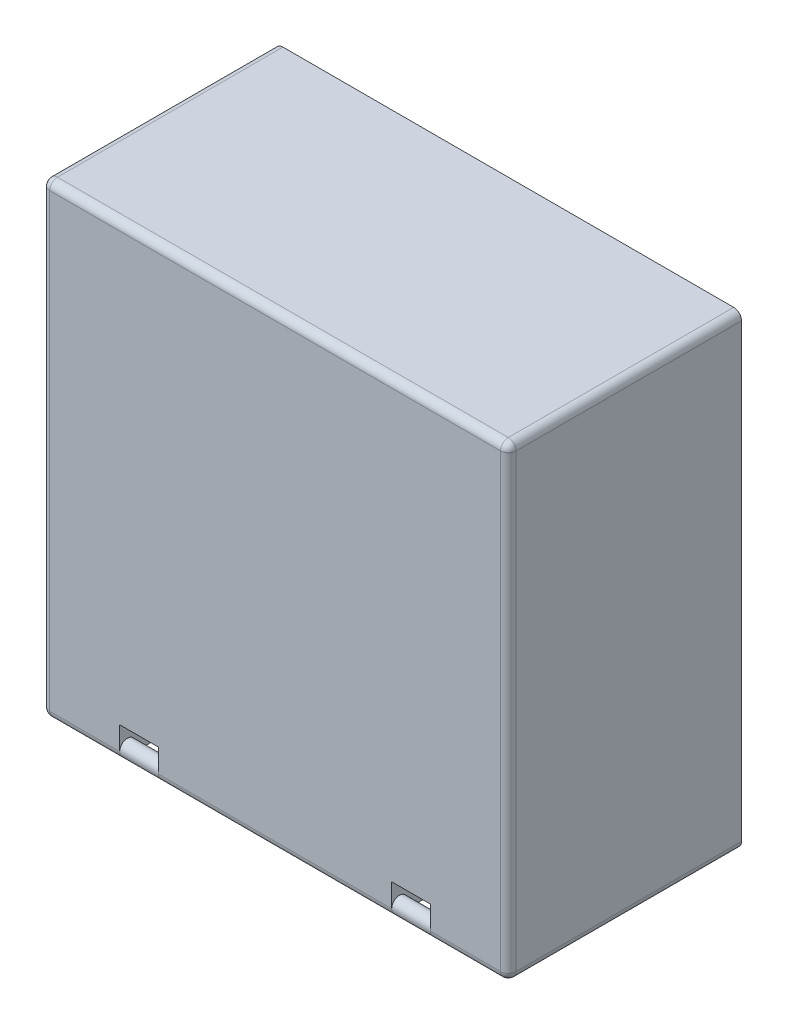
ISO-10303-21;
HEADER;
FILE_DESCRIPTION(('STEP AP214'),'2;1');
FILE_NAME('part.step','',(''),(''),'','','');
FILE_SCHEMA(('AUTOMOTIVE_DESIGN { 1 0 10303 214 1 1 1 1 }'));
ENDSEC;
DATA;
#1=APPLICATION_CONTEXT('core data for automotive mechanical design processes');
#2=APPLICATION_PROTOCOL_DEFINITION('international standard','automotive_design',2000,#1);
#3=PRODUCT_CONTEXT('',#1,'mechanical');
#4=PRODUCT('Part','Part','',(#3));
#5=PRODUCT_RELATED_PRODUCT_CATEGORY('part','',(#4));
#6=PRODUCT_DEFINITION_FORMATION('','',#4);
#7=PRODUCT_DEFINITION_CONTEXT('part definition',#1,'design');
#8=PRODUCT_DEFINITION('design','',#6,#7);
#9=PRODUCT_DEFINITION_SHAPE('','',#8);
#10=(LENGTH_UNIT() NAMED_UNIT(*) SI_UNIT(.MILLI.,.METRE.));
#11=(NAMED_UNIT(*) PLANE_ANGLE_UNIT() SI_UNIT($,.RADIAN.));
#12=(NAMED_UNIT(*) SI_UNIT($,.STERADIAN.) SOLID_ANGLE_UNIT());
#13=UNCERTAINTY_MEASURE_WITH_UNIT(LENGTH_MEASURE(1.E-05),#10,'distance_accuracy_value','');
#14=(GEOMETRIC_REPRESENTATION_CONTEXT(3) GLOBAL_UNCERTAINTY_ASSIGNED_CONTEXT((#13)) GLOBAL_UNIT_ASSIGNED_CONTEXT((#10,
#11,#12)) REPRESENTATION_CONTEXT('',''));
#15=CARTESIAN_POINT('',(0.,0.,0.));
#16=DIRECTION('',(0.,0.,1.));
#17=DIRECTION('',(1.,0.,0.));
#18=AXIS2_PLACEMENT_3D('',#15,#16,#17);
#19=CARTESIAN_POINT('',(-38.1,-38.1,38.1));
#20=DIRECTION('',(0.,1.,0.));
#21=DIRECTION('',(-1.,0.,0.));
#22=AXIS2_PLACEMENT_3D('',#19,#20,#21);
#23=PLANE('',#22);
#24=DIRECTION('',(0.,0.,-1.));
#25=VECTOR('',#24,1.);
#26=CARTESIAN_POINT('',(36.83,-38.1,38.1));
#27=LINE('',#26,#25);
#28=CARTESIAN_POINT('',(36.83,-38.1,4.57));
#29=VERTEX_POINT('',#28);
#30=CARTESIAN_POINT('',(36.83,-38.1,36.83));
#31=VERTEX_POINT('',#30);
#32=EDGE_CURVE('E498',#29,#31,#27,.F.);
#33=ORIENTED_EDGE('',*,*,#32,.T.);
#34=DIRECTION('',(1.,0.,0.));
#35=VECTOR('',#34,1.);
#36=CARTESIAN_POINT('',(-38.1,-38.1,36.83));
#37=LINE('',#36,#35);
#38=CARTESIAN_POINT('',(25.4,-38.1,36.83));
#39=VERTEX_POINT('',#38);
#40=EDGE_CURVE('E500',#31,#39,#37,.F.);
#41=ORIENTED_EDGE('',*,*,#40,.T.);
#42=DIRECTION('',(0.,0.,-1.));
#43=VECTOR('',#42,1.);
#44=CARTESIAN_POINT('',(25.4,-38.1,0.));
#45=LINE('',#44,#43);
#46=CARTESIAN_POINT('',(25.4,-38.1,33.02));
#47=VERTEX_POINT('',#46);
#48=EDGE_CURVE('E443',#39,#47,#45,.T.);
#49=ORIENTED_EDGE('',*,*,#48,.T.);
#50=DIRECTION('',(1.,0.,0.));
#51=VECTOR('',#50,1.);
#52=CARTESIAN_POINT('',(19.05,-38.1,33.02));
#53=LINE('',#52,#51);
#54=CARTESIAN_POINT('',(19.05,-38.1,33.02));
#55=VERTEX_POINT('',#54);
#56=EDGE_CURVE('E445',#55,#47,#53,.T.);
#57=ORIENTED_EDGE('',*,*,#56,.F.);
#58=DIRECTION('',(0.,0.,-1.));
#59=VECTOR('',#58,1.);
#60=CARTESIAN_POINT('',(19.05,-38.1,0.));
#61=LINE('',#60,#59);
#62=CARTESIAN_POINT('',(19.05,-38.1,36.83));
#63=VERTEX_POINT('',#62);
#64=EDGE_CURVE('E442',#63,#55,#61,.T.);
#65=ORIENTED_EDGE('',*,*,#64,.F.);
#66=DIRECTION('',(1.,0.,0.));
#67=VECTOR('',#66,1.);
#68=CARTESIAN_POINT('',(-38.1,-38.1,36.83));
#69=LINE('',#68,#67);
#70=CARTESIAN_POINT('',(-19.05,-38.1,36.83));
#71=VERTEX_POINT('',#70);
#72=EDGE_CURVE('E489',#63,#71,#69,.F.);
#73=ORIENTED_EDGE('',*,*,#72,.T.);
#74=DIRECTION('',(0.,0.,-1.));
#75=VECTOR('',#74,1.);
#76=CARTESIAN_POINT('',(-19.05,-38.1,0.));
#77=LINE('',#76,#75);
#78=CARTESIAN_POINT('',(-19.05,-38.1,33.02));
#79=VERTEX_POINT('',#78);
#80=EDGE_CURVE('E421',#71,#79,#77,.T.);
#81=ORIENTED_EDGE('',*,*,#80,.T.);
#82=DIRECTION('',(-1.,0.,0.));
#83=VECTOR('',#82,1.);
#84=CARTESIAN_POINT('',(-19.05,-38.1,33.02));
#85=LINE('',#84,#83);
#86=CARTESIAN_POINT('',(-25.4,-38.1,33.02));
#87=VERTEX_POINT('',#86);
#88=EDGE_CURVE('E430',#79,#87,#85,.T.);
#89=ORIENTED_EDGE('',*,*,#88,.T.);
#90=DIRECTION('',(0.,0.,-1.));
#91=VECTOR('',#90,1.);
#92=CARTESIAN_POINT('',(-25.4,-38.1,0.));
#93=LINE('',#92,#91);
#94=CARTESIAN_POINT('',(-25.4,-38.1,36.83));
#95=VERTEX_POINT('',#94);
#96=EDGE_CURVE('E422',#95,#87,#93,.T.);
#97=ORIENTED_EDGE('',*,*,#96,.F.);
#98=DIRECTION('',(1.,0.,0.));
#99=VECTOR('',#98,1.);
#100=CARTESIAN_POINT('',(-38.1,-38.1,36.83));
#101=LINE('',#100,#99);
#102=CARTESIAN_POINT('',(-36.83,-38.1,36.83));
#103=VERTEX_POINT('',#102);
#104=EDGE_CURVE('E491',#95,#103,#101,.F.);
#105=ORIENTED_EDGE('',*,*,#104,.T.);
#106=DIRECTION('',(0.,0.,-1.));
#107=VECTOR('',#106,1.);
#108=CARTESIAN_POINT('',(-36.83,-38.1,38.1));
#109=LINE('',#108,#107);
#110=CARTESIAN_POINT('',(-36.83,-38.1,4.57));
#111=VERTEX_POINT('',#110);
#112=EDGE_CURVE('E493',#103,#111,#109,.T.);
#113=ORIENTED_EDGE('',*,*,#112,.T.);
#114=DIRECTION('',(1.,0.,0.));
#115=VECTOR('',#114,1.);
#116=CARTESIAN_POINT('',(36.576,-38.1,4.57));
#117=LINE('',#116,#115);
#118=EDGE_CURVE('E495',#111,#29,#117,.T.);
#119=ORIENTED_EDGE('',*,*,#118,.T.);
#120=EDGE_LOOP('',(#33,#41,#49,#57,#65,#73,#81,#89,#97,#105,#113,#119));
#121=FACE_BOUND('',#120,.T.);
#122=DIRECTION('',(0.,0.,-1.));
#123=VECTOR('',#122,1.);
#124=CARTESIAN_POINT('',(-12.7,-38.1,21.24));
#125=LINE('',#124,#123);
#126=CARTESIAN_POINT('',(-12.7,-38.1,31.4));
#127=VERTEX_POINT('',#126);
#128=CARTESIAN_POINT('',(-12.7,-38.1,15.24));
#129=VERTEX_POINT('',#128);
#130=EDGE_CURVE('E59',#127,#129,#125,.T.);
#131=ORIENTED_EDGE('',*,*,#130,.F.);
#132=DIRECTION('',(1.,0.,0.));
#133=VECTOR('',#132,1.);
#134=CARTESIAN_POINT('',(12.7,-38.1,31.4));
#135=LINE('',#134,#133);
#136=CARTESIAN_POINT('',(12.7,-38.1,31.4));
#137=VERTEX_POINT('',#136);
#138=EDGE_CURVE('E589',#127,#137,#135,.T.);
#139=ORIENTED_EDGE('',*,*,#138,.T.);
#140=DIRECTION('',(0.,0.,1.));
#141=VECTOR('',#140,1.);
#142=CARTESIAN_POINT('',(12.7,-38.1,21.24));
#143=LINE('',#142,#141);
#144=CARTESIAN_POINT('',(12.7,-38.1,15.24));
#145=VERTEX_POINT('',#144);
#146=EDGE_CURVE('E66',#145,#137,#143,.T.);
#147=ORIENTED_EDGE('',*,*,#146,.F.);
#148=DIRECTION('',(1.,0.,0.));
#149=VECTOR('',#148,1.);
#150=CARTESIAN_POINT('',(-12.7,-38.1,15.24));
#151=LINE('',#150,#149);
#152=EDGE_CURVE('E593',#129,#145,#151,.T.);
#153=ORIENTED_EDGE('',*,*,#152,.F.);
#154=EDGE_LOOP('',(#131,#139,#147,#153));
#155=FACE_BOUND('',#154,.T.);
#156=ADVANCED_FACE('F43',(#121,#155),#23,.F.);
#157=CARTESIAN_POINT('',(0.,0.,0.));
#158=DIRECTION('',(0.,0.,-1.));
#159=DIRECTION('',(-1.,0.,0.));
#160=AXIS2_PLACEMENT_3D('',#157,#158,#159);
#161=PLANE('',#160);
#162=DIRECTION('',(0.,-1.,0.));
#163=VECTOR('',#162,1.);
#164=CARTESIAN_POINT('',(-36.576,0.,0.));
#165=LINE('',#164,#163);
#166=CARTESIAN_POINT('',(-36.576,36.576,0.));
#167=VERTEX_POINT('',#166);
#168=CARTESIAN_POINT('',(-36.576,-36.83,0.));
#169=VERTEX_POINT('',#168);
#170=EDGE_CURVE('E390',#167,#169,#165,.T.);
#171=ORIENTED_EDGE('',*,*,#170,.T.);
#172=CARTESIAN_POINT('',(-37.846,-36.83,0.));
#173=DIRECTION('',(0.,0.,-1.));
#174=DIRECTION('',(-1.,0.,0.));
#175=AXIS2_PLACEMENT_3D('',#172,#173,#174);
#176=CIRCLE('',#175,1.27);
#177=CARTESIAN_POINT('',(-37.338,-37.9939742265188,0.));
#178=VERTEX_POINT('',#177);
#179=EDGE_CURVE('E485',#169,#178,#176,.T.);
#180=ORIENTED_EDGE('',*,*,#179,.T.);
#181=CARTESIAN_POINT('',(-36.83,-36.83,0.));
#182=DIRECTION('',(0.,0.,-1.));
#183=DIRECTION('',(-1.,0.,0.));
#184=AXIS2_PLACEMENT_3D('',#181,#182,#183);
#185=CIRCLE('',#184,1.27);
#186=CARTESIAN_POINT('',(-38.1,-36.83,0.));
#187=VERTEX_POINT('',#186);
#188=EDGE_CURVE('E483',#178,#187,#185,.T.);
#189=ORIENTED_EDGE('',*,*,#188,.T.);
#190=DIRECTION('',(0.,-1.,0.));
#191=VECTOR('',#190,1.);
#192=CARTESIAN_POINT('',(-38.1,-38.1,0.));
#193=LINE('',#192,#191);
#194=CARTESIAN_POINT('',(-38.1,36.83,0.));
#195=VERTEX_POINT('',#194);
#196=EDGE_CURVE('E453',#195,#187,#193,.T.);
#197=ORIENTED_EDGE('',*,*,#196,.F.);
#198=CARTESIAN_POINT('',(-36.83,36.83,0.));
#199=DIRECTION('',(0.,0.,-1.));
#200=DIRECTION('',(-1.,0.,0.));
#201=AXIS2_PLACEMENT_3D('',#198,#199,#200);
#202=CIRCLE('',#201,1.27);
#203=CARTESIAN_POINT('',(-36.83,38.1,0.));
#204=VERTEX_POINT('',#203);
#205=EDGE_CURVE('E481',#195,#204,#202,.T.);
#206=ORIENTED_EDGE('',*,*,#205,.T.);
#207=DIRECTION('',(-1.,0.,0.));
#208=VECTOR('',#207,1.);
#209=CARTESIAN_POINT('',(-38.1,38.1,0.));
#210=LINE('',#209,#208);
#211=CARTESIAN_POINT('',(36.83,38.1,0.));
#212=VERTEX_POINT('',#211);
#213=EDGE_CURVE('E461',#212,#204,#210,.T.);
#214=ORIENTED_EDGE('',*,*,#213,.F.);
#215=CARTESIAN_POINT('',(36.83,36.83,0.));
#216=DIRECTION('',(0.,0.,-1.));
#217=DIRECTION('',(-1.,0.,0.));
#218=AXIS2_PLACEMENT_3D('',#215,#216,#217);
#219=CIRCLE('',#218,1.27);
#220=CARTESIAN_POINT('',(38.1,36.83,0.));
#221=VERTEX_POINT('',#220);
#222=EDGE_CURVE('E479',#212,#221,#219,.T.);
#223=ORIENTED_EDGE('',*,*,#222,.T.);
#224=DIRECTION('',(0.,1.,0.));
#225=VECTOR('',#224,1.);
#226=CARTESIAN_POINT('',(38.1,-38.1,0.));
#227=LINE('',#226,#225);
#228=CARTESIAN_POINT('',(38.1,-36.83,0.));
#229=VERTEX_POINT('',#228);
#230=EDGE_CURVE('E458',#229,#221,#227,.T.);
#231=ORIENTED_EDGE('',*,*,#230,.F.);
#232=CARTESIAN_POINT('',(36.83,-36.83,0.));
#233=DIRECTION('',(0.,0.,-1.));
#234=DIRECTION('',(-1.,0.,0.));
#235=AXIS2_PLACEMENT_3D('',#232,#233,#234);
#236=CIRCLE('',#235,1.27);
#237=CARTESIAN_POINT('',(37.338,-37.9939742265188,0.));
#238=VERTEX_POINT('',#237);
#239=EDGE_CURVE('E475',#229,#238,#236,.T.);
#240=ORIENTED_EDGE('',*,*,#239,.T.);
#241=CARTESIAN_POINT('',(37.846,-36.83,0.));
#242=DIRECTION('',(0.,0.,-1.));
#243=DIRECTION('',(-1.,0.,0.));
#244=AXIS2_PLACEMENT_3D('',#241,#242,#243);
#245=CIRCLE('',#244,1.27);
#246=CARTESIAN_POINT('',(36.576,-36.83,0.));
#247=VERTEX_POINT('',#246);
#248=EDGE_CURVE('E477',#238,#247,#245,.T.);
#249=ORIENTED_EDGE('',*,*,#248,.T.);
#250=DIRECTION('',(0.,1.,0.));
#251=VECTOR('',#250,1.);
#252=CARTESIAN_POINT('',(36.576,0.,0.));
#253=LINE('',#252,#251);
#254=CARTESIAN_POINT('',(36.576,36.576,0.));
#255=VERTEX_POINT('',#254);
#256=EDGE_CURVE('E410',#247,#255,#253,.T.);
#257=ORIENTED_EDGE('',*,*,#256,.T.);
#258=DIRECTION('',(-1.,0.,0.));
#259=VECTOR('',#258,1.);
#260=CARTESIAN_POINT('',(0.,36.576,0.));
#261=LINE('',#260,#259);
#262=EDGE_CURVE('E382',#255,#167,#261,.T.);
#263=ORIENTED_EDGE('',*,*,#262,.T.);
#264=EDGE_LOOP('',(#171,#180,#189,#197,#206,#214,#223,#231,#240,#249,#257,#263));
#265=FACE_BOUND('',#264,.T.);
#266=ADVANCED_FACE('F609',(#265),#161,.T.);
#267=CARTESIAN_POINT('',(-38.1,-36.576,38.1));
#268=DIRECTION('',(0.,1.,0.));
#269=DIRECTION('',(-1.,0.,0.));
#270=AXIS2_PLACEMENT_3D('',#267,#268,#269);
#271=PLANE('',#270);
#272=DIRECTION('',(0.,0.,-1.));
#273=VECTOR('',#272,1.);
#274=CARTESIAN_POINT('',(36.576,-36.576,38.1));
#275=LINE('',#274,#273);
#276=CARTESIAN_POINT('',(36.576,-36.576,36.576));
#277=VERTEX_POINT('',#276);
#278=CARTESIAN_POINT('',(36.576,-36.576,3.3));
#279=VERTEX_POINT('',#278);
#280=EDGE_CURVE('E342',#277,#279,#275,.T.);
#281=ORIENTED_EDGE('',*,*,#280,.T.);
#282=DIRECTION('',(-1.,0.,0.));
#283=VECTOR('',#282,1.);
#284=CARTESIAN_POINT('',(36.576,-36.576,3.3));
#285=LINE('',#284,#283);
#286=CARTESIAN_POINT('',(-36.576,-36.576,3.3));
#287=VERTEX_POINT('',#286);
#288=EDGE_CURVE('E319',#279,#287,#285,.T.);
#289=ORIENTED_EDGE('',*,*,#288,.T.);
#290=DIRECTION('',(0.,0.,-1.));
#291=VECTOR('',#290,1.);
#292=CARTESIAN_POINT('',(-36.576,-36.576,38.1));
#293=LINE('',#292,#291);
#294=CARTESIAN_POINT('',(-36.576,-36.576,36.576));
#295=VERTEX_POINT('',#294);
#296=EDGE_CURVE('E338',#295,#287,#293,.T.);
#297=ORIENTED_EDGE('',*,*,#296,.F.);
#298=DIRECTION('',(1.,0.,0.));
#299=VECTOR('',#298,1.);
#300=CARTESIAN_POINT('',(0.,-36.576,36.576));
#301=LINE('',#300,#299);
#302=CARTESIAN_POINT('',(-26.924,-36.576,36.576));
#303=VERTEX_POINT('',#302);
#304=EDGE_CURVE('E365',#295,#303,#301,.T.);
#305=ORIENTED_EDGE('',*,*,#304,.T.);
#306=DIRECTION('',(0.,0.,-1.));
#307=VECTOR('',#306,1.);
#308=CARTESIAN_POINT('',(-26.924,-36.576,0.));
#309=LINE('',#308,#307);
#310=CARTESIAN_POINT('',(-26.924,-36.576,31.496));
#311=VERTEX_POINT('',#310);
#312=EDGE_CURVE('E334',#303,#311,#309,.T.);
#313=ORIENTED_EDGE('',*,*,#312,.T.);
#314=DIRECTION('',(-1.,0.,0.));
#315=VECTOR('',#314,1.);
#316=CARTESIAN_POINT('',(-19.05,-36.576,31.496));
#317=LINE('',#316,#315);
#318=CARTESIAN_POINT('',(-17.526,-36.576,31.496));
#319=VERTEX_POINT('',#318);
#320=EDGE_CURVE('E366',#319,#311,#317,.T.);
#321=ORIENTED_EDGE('',*,*,#320,.F.);
#322=DIRECTION('',(0.,0.,-1.));
#323=VECTOR('',#322,1.);
#324=CARTESIAN_POINT('',(-17.526,-36.576,0.));
#325=LINE('',#324,#323);
#326=CARTESIAN_POINT('',(-17.526,-36.576,36.576));
#327=VERTEX_POINT('',#326);
#328=EDGE_CURVE('E327',#327,#319,#325,.T.);
#329=ORIENTED_EDGE('',*,*,#328,.F.);
#330=DIRECTION('',(1.,0.,0.));
#331=VECTOR('',#330,1.);
#332=CARTESIAN_POINT('',(0.,-36.576,36.576));
#333=LINE('',#332,#331);
#334=CARTESIAN_POINT('',(17.526,-36.576,36.576));
#335=VERTEX_POINT('',#334);
#336=EDGE_CURVE('E348',#327,#335,#333,.T.);
#337=ORIENTED_EDGE('',*,*,#336,.T.);
#338=DIRECTION('',(0.,0.,-1.));
#339=VECTOR('',#338,1.);
#340=CARTESIAN_POINT('',(17.526,-36.576,38.1));
#341=LINE('',#340,#339);
#342=CARTESIAN_POINT('',(17.526,-36.576,31.496));
#343=VERTEX_POINT('',#342);
#344=EDGE_CURVE('E359',#335,#343,#341,.T.);
#345=ORIENTED_EDGE('',*,*,#344,.T.);
#346=DIRECTION('',(1.,0.,0.));
#347=VECTOR('',#346,1.);
#348=CARTESIAN_POINT('',(19.05,-36.576,31.496));
#349=LINE('',#348,#347);
#350=CARTESIAN_POINT('',(26.924,-36.576,31.496));
#351=VERTEX_POINT('',#350);
#352=EDGE_CURVE('E354',#343,#351,#349,.T.);
#353=ORIENTED_EDGE('',*,*,#352,.T.);
#354=DIRECTION('',(0.,0.,-1.));
#355=VECTOR('',#354,1.);
#356=CARTESIAN_POINT('',(26.924,-36.576,38.1));
#357=LINE('',#356,#355);
#358=CARTESIAN_POINT('',(26.924,-36.576,36.576));
#359=VERTEX_POINT('',#358);
#360=EDGE_CURVE('E350',#359,#351,#357,.T.);
#361=ORIENTED_EDGE('',*,*,#360,.F.);
#362=DIRECTION('',(1.,0.,0.));
#363=VECTOR('',#362,1.);
#364=CARTESIAN_POINT('',(0.,-36.576,36.576));
#365=LINE('',#364,#363);
#366=EDGE_CURVE('E346',#359,#277,#365,.T.);
#367=ORIENTED_EDGE('',*,*,#366,.T.);
#368=EDGE_LOOP('',(#281,#289,#297,#305,#313,#321,#329,#337,#345,#353,#361,#367));
#369=FACE_BOUND('',#368,.T.);
#370=ADVANCED_FACE('F615',(#369),#271,.T.);
#371=CARTESIAN_POINT('',(0.,0.,38.1));
#372=DIRECTION('',(0.,0.,-1.));
#373=DIRECTION('',(-1.,0.,0.));
#374=AXIS2_PLACEMENT_3D('',#371,#372,#373);
#375=PLANE('',#374);
#376=DIRECTION('',(0.,-1.,0.));
#377=VECTOR('',#376,1.);
#378=CARTESIAN_POINT('',(25.4,0.,38.1));
#379=LINE('',#378,#377);
#380=CARTESIAN_POINT('',(25.4,-33.02,38.1));
#381=VERTEX_POINT('',#380);
#382=CARTESIAN_POINT('',(25.4,-36.83,38.1));
#383=VERTEX_POINT('',#382);
#384=EDGE_CURVE('E438',#381,#383,#379,.T.);
#385=ORIENTED_EDGE('',*,*,#384,.T.);
#386=DIRECTION('',(1.,0.,0.));
#387=VECTOR('',#386,1.);
#388=CARTESIAN_POINT('',(0.,-36.83,38.1));
#389=LINE('',#388,#387);
#390=CARTESIAN_POINT('',(36.83,-36.83,38.1));
#391=VERTEX_POINT('',#390);
#392=EDGE_CURVE('E527',#383,#391,#389,.T.);
#393=ORIENTED_EDGE('',*,*,#392,.T.);
#394=DIRECTION('',(0.,1.,0.));
#395=VECTOR('',#394,1.);
#396=CARTESIAN_POINT('',(36.83,0.,38.1));
#397=LINE('',#396,#395);
#398=CARTESIAN_POINT('',(36.83,36.83,38.1));
#399=VERTEX_POINT('',#398);
#400=EDGE_CURVE('E525',#391,#399,#397,.T.);
#401=ORIENTED_EDGE('',*,*,#400,.T.);
#402=DIRECTION('',(-1.,0.,0.));
#403=VECTOR('',#402,1.);
#404=CARTESIAN_POINT('',(0.,36.83,38.1));
#405=LINE('',#404,#403);
#406=CARTESIAN_POINT('',(-36.83,36.83,38.1));
#407=VERTEX_POINT('',#406);
#408=EDGE_CURVE('E523',#399,#407,#405,.T.);
#409=ORIENTED_EDGE('',*,*,#408,.T.);
#410=DIRECTION('',(0.,-1.,0.));
#411=VECTOR('',#410,1.);
#412=CARTESIAN_POINT('',(-36.83,0.,38.1));
#413=LINE('',#412,#411);
#414=CARTESIAN_POINT('',(-36.83,-36.83,38.1));
#415=VERTEX_POINT('',#414);
#416=EDGE_CURVE('E521',#407,#415,#413,.T.);
#417=ORIENTED_EDGE('',*,*,#416,.T.);
#418=DIRECTION('',(1.,0.,0.));
#419=VECTOR('',#418,1.);
#420=CARTESIAN_POINT('',(0.,-36.83,38.1));
#421=LINE('',#420,#419);
#422=CARTESIAN_POINT('',(-25.4,-36.83,38.1));
#423=VERTEX_POINT('',#422);
#424=EDGE_CURVE('E519',#415,#423,#421,.T.);
#425=ORIENTED_EDGE('',*,*,#424,.T.);
#426=DIRECTION('',(0.,-1.,0.));
#427=VECTOR('',#426,1.);
#428=CARTESIAN_POINT('',(-25.4,0.,38.1));
#429=LINE('',#428,#427);
#430=CARTESIAN_POINT('',(-25.4,-33.02,38.1));
#431=VERTEX_POINT('',#430);
#432=EDGE_CURVE('E417',#431,#423,#429,.T.);
#433=ORIENTED_EDGE('',*,*,#432,.F.);
#434=DIRECTION('',(-1.,0.,0.));
#435=VECTOR('',#434,1.);
#436=CARTESIAN_POINT('',(-19.05,-33.02,38.1));
#437=LINE('',#436,#435);
#438=CARTESIAN_POINT('',(-19.05,-33.02,38.1));
#439=VERTEX_POINT('',#438);
#440=EDGE_CURVE('E425',#439,#431,#437,.T.);
#441=ORIENTED_EDGE('',*,*,#440,.F.);
#442=DIRECTION('',(0.,-1.,0.));
#443=VECTOR('',#442,1.);
#444=CARTESIAN_POINT('',(-19.05,0.,38.1));
#445=LINE('',#444,#443);
#446=CARTESIAN_POINT('',(-19.05,-36.83,38.1));
#447=VERTEX_POINT('',#446);
#448=EDGE_CURVE('E418',#439,#447,#445,.T.);
#449=ORIENTED_EDGE('',*,*,#448,.T.);
#450=DIRECTION('',(1.,0.,0.));
#451=VECTOR('',#450,1.);
#452=CARTESIAN_POINT('',(0.,-36.83,38.1));
#453=LINE('',#452,#451);
#454=CARTESIAN_POINT('',(19.05,-36.83,38.1));
#455=VERTEX_POINT('',#454);
#456=EDGE_CURVE('E516',#447,#455,#453,.T.);
#457=ORIENTED_EDGE('',*,*,#456,.T.);
#458=DIRECTION('',(0.,-1.,0.));
#459=VECTOR('',#458,1.);
#460=CARTESIAN_POINT('',(19.05,0.,38.1));
#461=LINE('',#460,#459);
#462=CARTESIAN_POINT('',(19.05,-33.02,38.1));
#463=VERTEX_POINT('',#462);
#464=EDGE_CURVE('E439',#463,#455,#461,.T.);
#465=ORIENTED_EDGE('',*,*,#464,.F.);
#466=DIRECTION('',(1.,0.,0.));
#467=VECTOR('',#466,1.);
#468=CARTESIAN_POINT('',(19.05,-33.02,38.1));
#469=LINE('',#468,#467);
#470=EDGE_CURVE('E450',#463,#381,#469,.T.);
#471=ORIENTED_EDGE('',*,*,#470,.T.);
#472=EDGE_LOOP('',(#385,#393,#401,#409,#417,#425,#433,#441,#449,#457,#465,#471));
#473=FACE_BOUND('',#472,.T.);
#474=ADVANCED_FACE('F625',(#473),#375,.F.);
#475=CARTESIAN_POINT('',(-38.1,-38.1,38.1));
#476=DIRECTION('',(1.,0.,0.));
#477=DIRECTION('',(0.,1.,0.));
#478=AXIS2_PLACEMENT_3D('',#475,#476,#477);
#479=PLANE('',#478);
#480=ORIENTED_EDGE('',*,*,#196,.T.);
#481=DIRECTION('',(0.,0.,-1.));
#482=VECTOR('',#481,1.);
#483=CARTESIAN_POINT('',(-38.1,-36.83,38.1));
#484=LINE('',#483,#482);
#485=CARTESIAN_POINT('',(-38.1,-36.83,36.83));
#486=VERTEX_POINT('',#485);
#487=EDGE_CURVE('E508',#187,#486,#484,.F.);
#488=ORIENTED_EDGE('',*,*,#487,.T.);
#489=DIRECTION('',(0.,-1.,0.));
#490=VECTOR('',#489,1.);
#491=CARTESIAN_POINT('',(-38.1,-38.1,36.83));
#492=LINE('',#491,#490);
#493=CARTESIAN_POINT('',(-38.1,36.83,36.83));
#494=VERTEX_POINT('',#493);
#495=EDGE_CURVE('E504',#486,#494,#492,.F.);
#496=ORIENTED_EDGE('',*,*,#495,.T.);
#497=DIRECTION('',(0.,0.,-1.));
#498=VECTOR('',#497,1.);
#499=CARTESIAN_POINT('',(-38.1,36.83,38.1));
#500=LINE('',#499,#498);
#501=EDGE_CURVE('E506',#494,#195,#500,.T.);
#502=ORIENTED_EDGE('',*,*,#501,.T.);
#503=EDGE_LOOP('',(#480,#488,#496,#502));
#504=FACE_BOUND('',#503,.T.);
#505=ADVANCED_FACE('F622',(#504),#479,.F.);
#506=CARTESIAN_POINT('',(38.1,-38.1,38.1));
#507=DIRECTION('',(-1.,0.,0.));
#508=DIRECTION('',(0.,0.,1.));
#509=AXIS2_PLACEMENT_3D('',#506,#507,#508);
#510=PLANE('',#509);
#511=ORIENTED_EDGE('',*,*,#230,.T.);
#512=DIRECTION('',(0.,0.,-1.));
#513=VECTOR('',#512,1.);
#514=CARTESIAN_POINT('',(38.1,36.83,38.1));
#515=LINE('',#514,#513);
#516=CARTESIAN_POINT('',(38.1,36.83,36.83));
#517=VERTEX_POINT('',#516);
#518=EDGE_CURVE('E533',#221,#517,#515,.F.);
#519=ORIENTED_EDGE('',*,*,#518,.T.);
#520=DIRECTION('',(0.,1.,0.));
#521=VECTOR('',#520,1.);
#522=CARTESIAN_POINT('',(38.1,-38.1,36.83));
#523=LINE('',#522,#521);
#524=CARTESIAN_POINT('',(38.1,-36.83,36.83));
#525=VERTEX_POINT('',#524);
#526=EDGE_CURVE('E529',#517,#525,#523,.F.);
#527=ORIENTED_EDGE('',*,*,#526,.T.);
#528=DIRECTION('',(0.,0.,-1.));
#529=VECTOR('',#528,1.);
#530=CARTESIAN_POINT('',(38.1,-36.83,38.1));
#531=LINE('',#530,#529);
#532=EDGE_CURVE('E531',#525,#229,#531,.T.);
#533=ORIENTED_EDGE('',*,*,#532,.T.);
#534=EDGE_LOOP('',(#511,#519,#527,#533));
#535=FACE_BOUND('',#534,.T.);
#536=ADVANCED_FACE('F620',(#535),#510,.F.);
#537=CARTESIAN_POINT('',(-38.1,38.1,38.1));
#538=DIRECTION('',(0.,-1.,0.));
#539=DIRECTION('',(0.,0.,-1.));
#540=AXIS2_PLACEMENT_3D('',#537,#538,#539);
#541=PLANE('',#540);
#542=ORIENTED_EDGE('',*,*,#213,.T.);
#543=DIRECTION('',(0.,0.,-1.));
#544=VECTOR('',#543,1.);
#545=CARTESIAN_POINT('',(-36.83,38.1,38.1));
#546=LINE('',#545,#544);
#547=CARTESIAN_POINT('',(-36.83,38.1,36.83));
#548=VERTEX_POINT('',#547);
#549=EDGE_CURVE('E514',#204,#548,#546,.F.);
#550=ORIENTED_EDGE('',*,*,#549,.T.);
#551=DIRECTION('',(-1.,0.,0.));
#552=VECTOR('',#551,1.);
#553=CARTESIAN_POINT('',(-38.1,38.1,36.83));
#554=LINE('',#553,#552);
#555=CARTESIAN_POINT('',(36.83,38.1,36.83));
#556=VERTEX_POINT('',#555);
#557=EDGE_CURVE('E512',#548,#556,#554,.F.);
#558=ORIENTED_EDGE('',*,*,#557,.T.);
#559=DIRECTION('',(0.,0.,-1.));
#560=VECTOR('',#559,1.);
#561=CARTESIAN_POINT('',(36.83,38.1,38.1));
#562=LINE('',#561,#560);
#563=EDGE_CURVE('E510',#556,#212,#562,.T.);
#564=ORIENTED_EDGE('',*,*,#563,.T.);
#565=EDGE_LOOP('',(#542,#550,#558,#564));
#566=FACE_BOUND('',#565,.T.);
#567=ADVANCED_FACE('F747',(#566),#541,.F.);
#568=CARTESIAN_POINT('',(19.05,0.,0.));
#569=DIRECTION('',(1.,0.,0.));
#570=DIRECTION('',(0.,0.,-1.));
#571=AXIS2_PLACEMENT_3D('',#568,#569,#570);
#572=PLANE('',#571);
#573=ORIENTED_EDGE('',*,*,#64,.T.);
#574=CARTESIAN_POINT('',(19.05,-38.1,38.1));
#575=DIRECTION('',(1.,0.,0.));
#576=DIRECTION('',(0.,0.,-1.));
#577=AXIS2_PLACEMENT_3D('',#574,#575,#576);
#578=CIRCLE('',#577,5.08);
#579=EDGE_CURVE('E587',#55,#463,#578,.T.);
#580=ORIENTED_EDGE('',*,*,#579,.T.);
#581=ORIENTED_EDGE('',*,*,#464,.T.);
#582=CARTESIAN_POINT('',(19.05,-36.83,36.83));
#583=DIRECTION('',(1.,0.,0.));
#584=DIRECTION('',(0.,0.,-1.));
#585=AXIS2_PLACEMENT_3D('',#582,#583,#584);
#586=CIRCLE('',#585,1.27);
#587=EDGE_CURVE('E433',#455,#63,#586,.F.);
#588=ORIENTED_EDGE('',*,*,#587,.T.);
#589=EDGE_LOOP('',(#573,#580,#581,#588));
#590=FACE_BOUND('',#589,.T.);
#591=ADVANCED_FACE('F710',(#590),#572,.T.);
#592=CARTESIAN_POINT('',(25.4,0.,0.));
#593=DIRECTION('',(1.,0.,0.));
#594=DIRECTION('',(0.,0.,-1.));
#595=AXIS2_PLACEMENT_3D('',#592,#593,#594);
#596=PLANE('',#595);
#597=ORIENTED_EDGE('',*,*,#384,.F.);
#598=CARTESIAN_POINT('',(25.4,-38.1,38.1));
#599=DIRECTION('',(1.,0.,0.));
#600=DIRECTION('',(0.,0.,-1.));
#601=AXIS2_PLACEMENT_3D('',#598,#599,#600);
#602=CIRCLE('',#601,5.08);
#603=EDGE_CURVE('E585',#381,#47,#602,.F.);
#604=ORIENTED_EDGE('',*,*,#603,.T.);
#605=ORIENTED_EDGE('',*,*,#48,.F.);
#606=CARTESIAN_POINT('',(25.4,-36.83,36.83));
#607=DIRECTION('',(1.,0.,0.));
#608=DIRECTION('',(0.,0.,-1.));
#609=AXIS2_PLACEMENT_3D('',#606,#607,#608);
#610=CIRCLE('',#609,1.27);
#611=EDGE_CURVE('E464',#39,#383,#610,.T.);
#612=ORIENTED_EDGE('',*,*,#611,.T.);
#613=EDGE_LOOP('',(#597,#604,#605,#612));
#614=FACE_BOUND('',#613,.T.);
#615=ADVANCED_FACE('F728',(#614),#596,.F.);
#616=CARTESIAN_POINT('',(15.4578975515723,-36.83,36.83));
#617=DIRECTION('',(1.,0.,0.));
#618=DIRECTION('',(0.,0.,-1.));
#619=AXIS2_PLACEMENT_3D('',#616,#617,#618);
#620=CYLINDRICAL_SURFACE('',#619,1.27);
#621=EDGE_CURVE('E436',#63,#455,#586,.F.);
#622=ORIENTED_EDGE('',*,*,#621,.F.);
#623=ORIENTED_EDGE('',*,*,#587,.F.);
#624=EDGE_LOOP('',(#622,#623));
#625=FACE_BOUND('',#624,.T.);
#626=EDGE_CURVE('E467',#383,#39,#610,.T.);
#627=ORIENTED_EDGE('',*,*,#626,.F.);
#628=ORIENTED_EDGE('',*,*,#611,.F.);
#629=EDGE_LOOP('',(#627,#628));
#630=FACE_BOUND('',#629,.T.);
#631=ADVANCED_FACE('F720',(#625,#630),#620,.T.);
#632=CARTESIAN_POINT('',(-19.05,0.,0.));
#633=DIRECTION('',(-1.,0.,0.));
#634=DIRECTION('',(0.,0.,-1.));
#635=AXIS2_PLACEMENT_3D('',#632,#633,#634);
#636=PLANE('',#635);
#637=ORIENTED_EDGE('',*,*,#448,.F.);
#638=CARTESIAN_POINT('',(-19.05,-38.1,38.1));
#639=DIRECTION('',(-1.,0.,0.));
#640=DIRECTION('',(0.,0.,1.));
#641=AXIS2_PLACEMENT_3D('',#638,#639,#640);
#642=CIRCLE('',#641,5.08);
#643=EDGE_CURVE('E583',#439,#79,#642,.T.);
#644=ORIENTED_EDGE('',*,*,#643,.T.);
#645=ORIENTED_EDGE('',*,*,#80,.F.);
#646=CARTESIAN_POINT('',(-19.05,-36.83,36.83));
#647=DIRECTION('',(-1.,0.,0.));
#648=DIRECTION('',(0.,0.,1.));
#649=AXIS2_PLACEMENT_3D('',#646,#647,#648);
#650=CIRCLE('',#649,1.27);
#651=EDGE_CURVE('E414',#447,#71,#650,.T.);
#652=ORIENTED_EDGE('',*,*,#651,.F.);
#653=EDGE_LOOP('',(#637,#644,#645,#652));
#654=FACE_BOUND('',#653,.T.);
#655=ADVANCED_FACE('F732',(#654),#636,.T.);
#656=CARTESIAN_POINT('',(-25.4,0.,0.));
#657=DIRECTION('',(-1.,0.,0.));
#658=DIRECTION('',(0.,0.,-1.));
#659=AXIS2_PLACEMENT_3D('',#656,#657,#658);
#660=PLANE('',#659);
#661=ORIENTED_EDGE('',*,*,#96,.T.);
#662=CARTESIAN_POINT('',(-25.4,-38.1,38.1));
#663=DIRECTION('',(-1.,0.,0.));
#664=DIRECTION('',(0.,0.,1.));
#665=AXIS2_PLACEMENT_3D('',#662,#663,#664);
#666=CIRCLE('',#665,5.08);
#667=EDGE_CURVE('E534',#87,#431,#666,.F.);
#668=ORIENTED_EDGE('',*,*,#667,.T.);
#669=ORIENTED_EDGE('',*,*,#432,.T.);
#670=CARTESIAN_POINT('',(-25.4,-36.83,36.83));
#671=DIRECTION('',(-1.,0.,0.));
#672=DIRECTION('',(0.,0.,1.));
#673=AXIS2_PLACEMENT_3D('',#670,#671,#672);
#674=CIRCLE('',#673,1.27);
#675=EDGE_CURVE('E468',#95,#423,#674,.F.);
#676=ORIENTED_EDGE('',*,*,#675,.F.);
#677=EDGE_LOOP('',(#661,#668,#669,#676));
#678=FACE_BOUND('',#677,.T.);
#679=ADVANCED_FACE('F739',(#678),#660,.F.);
#680=CARTESIAN_POINT('',(22.6421024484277,-36.83,36.83));
#681=DIRECTION('',(-1.,0.,0.));
#682=DIRECTION('',(0.,0.,1.));
#683=AXIS2_PLACEMENT_3D('',#680,#681,#682);
#684=CYLINDRICAL_SURFACE('',#683,1.27);
#685=ORIENTED_EDGE('',*,*,#651,.T.);
#686=EDGE_CURVE('E341',#71,#447,#650,.T.);
#687=ORIENTED_EDGE('',*,*,#686,.T.);
#688=EDGE_LOOP('',(#685,#687));
#689=FACE_BOUND('',#688,.T.);
#690=ORIENTED_EDGE('',*,*,#675,.T.);
#691=EDGE_CURVE('E471',#423,#95,#674,.F.);
#692=ORIENTED_EDGE('',*,*,#691,.T.);
#693=EDGE_LOOP('',(#690,#692));
#694=FACE_BOUND('',#693,.T.);
#695=ADVANCED_FACE('F831',(#689,#694),#684,.T.);
#696=CARTESIAN_POINT('',(-17.526,0.,0.));
#697=DIRECTION('',(-1.,0.,0.));
#698=DIRECTION('',(0.,0.,-1.));
#699=AXIS2_PLACEMENT_3D('',#696,#697,#698);
#700=PLANE('',#699);
#701=ORIENTED_EDGE('',*,*,#328,.T.);
#702=DIRECTION('',(0.,1.,0.));
#703=VECTOR('',#702,1.);
#704=CARTESIAN_POINT('',(-17.526,0.,31.496));
#705=LINE('',#704,#703);
#706=CARTESIAN_POINT('',(-17.526,-31.496,31.496));
#707=VERTEX_POINT('',#706);
#708=EDGE_CURVE('E330',#319,#707,#705,.T.);
#709=ORIENTED_EDGE('',*,*,#708,.T.);
#710=DIRECTION('',(0.,0.,-1.));
#711=VECTOR('',#710,1.);
#712=CARTESIAN_POINT('',(-17.526,-31.496,0.));
#713=LINE('',#712,#711);
#714=CARTESIAN_POINT('',(-17.526,-31.496,36.576));
#715=VERTEX_POINT('',#714);
#716=EDGE_CURVE('E333',#715,#707,#713,.T.);
#717=ORIENTED_EDGE('',*,*,#716,.F.);
#718=DIRECTION('',(0.,-1.,0.));
#719=VECTOR('',#718,1.);
#720=CARTESIAN_POINT('',(-17.526,0.,36.576));
#721=LINE('',#720,#719);
#722=EDGE_CURVE('E331',#715,#327,#721,.T.);
#723=ORIENTED_EDGE('',*,*,#722,.T.);
#724=EDGE_LOOP('',(#701,#709,#717,#723));
#725=FACE_BOUND('',#724,.T.);
#726=ADVANCED_FACE('F832',(#725),#700,.F.);
#727=CARTESIAN_POINT('',(-26.924,0.,0.));
#728=DIRECTION('',(-1.,0.,0.));
#729=DIRECTION('',(0.,0.,-1.));
#730=AXIS2_PLACEMENT_3D('',#727,#728,#729);
#731=PLANE('',#730);
#732=ORIENTED_EDGE('',*,*,#312,.F.);
#733=DIRECTION('',(0.,-1.,0.));
#734=VECTOR('',#733,1.);
#735=CARTESIAN_POINT('',(-26.924,0.,36.576));
#736=LINE('',#735,#734);
#737=CARTESIAN_POINT('',(-26.924,-31.496,36.576));
#738=VERTEX_POINT('',#737);
#739=EDGE_CURVE('E326',#738,#303,#736,.T.);
#740=ORIENTED_EDGE('',*,*,#739,.F.);
#741=DIRECTION('',(0.,0.,-1.));
#742=VECTOR('',#741,1.);
#743=CARTESIAN_POINT('',(-26.924,-31.496,0.));
#744=LINE('',#743,#742);
#745=CARTESIAN_POINT('',(-26.924,-31.496,31.496));
#746=VERTEX_POINT('',#745);
#747=EDGE_CURVE('E377',#738,#746,#744,.T.);
#748=ORIENTED_EDGE('',*,*,#747,.T.);
#749=DIRECTION('',(0.,1.,0.));
#750=VECTOR('',#749,1.);
#751=CARTESIAN_POINT('',(-26.924,0.,31.496));
#752=LINE('',#751,#750);
#753=EDGE_CURVE('E371',#311,#746,#752,.T.);
#754=ORIENTED_EDGE('',*,*,#753,.F.);
#755=EDGE_LOOP('',(#732,#740,#748,#754));
#756=FACE_BOUND('',#755,.T.);
#757=ADVANCED_FACE('F839',(#756),#731,.T.);
#758=CARTESIAN_POINT('',(0.,0.,36.576));
#759=DIRECTION('',(0.,0.,-1.));
#760=DIRECTION('',(-1.,0.,0.));
#761=AXIS2_PLACEMENT_3D('',#758,#759,#760);
#762=PLANE('',#761);
#763=DIRECTION('',(0.,-1.,0.));
#764=VECTOR('',#763,1.);
#765=CARTESIAN_POINT('',(-36.576,0.,36.576));
#766=LINE('',#765,#764);
#767=CARTESIAN_POINT('',(-36.576,36.576,36.576));
#768=VERTEX_POINT('',#767);
#769=EDGE_CURVE('E349',#768,#295,#766,.T.);
#770=ORIENTED_EDGE('',*,*,#769,.F.);
#771=DIRECTION('',(-1.,0.,0.));
#772=VECTOR('',#771,1.);
#773=CARTESIAN_POINT('',(0.,36.576,36.576));
#774=LINE('',#773,#772);
#775=CARTESIAN_POINT('',(36.576,36.576,36.576));
#776=VERTEX_POINT('',#775);
#777=EDGE_CURVE('E393',#776,#768,#774,.T.);
#778=ORIENTED_EDGE('',*,*,#777,.F.);
#779=DIRECTION('',(0.,1.,0.));
#780=VECTOR('',#779,1.);
#781=CARTESIAN_POINT('',(36.576,0.,36.576));
#782=LINE('',#781,#780);
#783=EDGE_CURVE('E374',#277,#776,#782,.T.);
#784=ORIENTED_EDGE('',*,*,#783,.F.);
#785=ORIENTED_EDGE('',*,*,#366,.F.);
#786=DIRECTION('',(0.,-1.,0.));
#787=VECTOR('',#786,1.);
#788=CARTESIAN_POINT('',(26.924,0.,36.576));
#789=LINE('',#788,#787);
#790=CARTESIAN_POINT('',(26.924,-31.496,36.576));
#791=VERTEX_POINT('',#790);
#792=EDGE_CURVE('E353',#791,#359,#789,.T.);
#793=ORIENTED_EDGE('',*,*,#792,.F.);
#794=DIRECTION('',(1.,0.,0.));
#795=VECTOR('',#794,1.);
#796=CARTESIAN_POINT('',(19.05,-31.496,36.576));
#797=LINE('',#796,#795);
#798=CARTESIAN_POINT('',(17.526,-31.496,36.576));
#799=VERTEX_POINT('',#798);
#800=EDGE_CURVE('E387',#799,#791,#797,.T.);
#801=ORIENTED_EDGE('',*,*,#800,.F.);
#802=DIRECTION('',(0.,-1.,0.));
#803=VECTOR('',#802,1.);
#804=CARTESIAN_POINT('',(17.526,0.,36.576));
#805=LINE('',#804,#803);
#806=EDGE_CURVE('E362',#799,#335,#805,.T.);
#807=ORIENTED_EDGE('',*,*,#806,.T.);
#808=ORIENTED_EDGE('',*,*,#336,.F.);
#809=ORIENTED_EDGE('',*,*,#722,.F.);
#810=DIRECTION('',(-1.,0.,0.));
#811=VECTOR('',#810,1.);
#812=CARTESIAN_POINT('',(-19.05,-31.496,36.576));
#813=LINE('',#812,#811);
#814=EDGE_CURVE('E329',#715,#738,#813,.T.);
#815=ORIENTED_EDGE('',*,*,#814,.T.);
#816=ORIENTED_EDGE('',*,*,#739,.T.);
#817=ORIENTED_EDGE('',*,*,#304,.F.);
#818=EDGE_LOOP('',(#770,#778,#784,#785,#793,#801,#807,#808,#809,#815,#816,#817));
#819=FACE_BOUND('',#818,.T.);
#820=ADVANCED_FACE('F809',(#819),#762,.T.);
#821=CARTESIAN_POINT('',(-36.576,-38.1,38.1));
#822=DIRECTION('',(1.,0.,0.));
#823=DIRECTION('',(0.,1.,0.));
#824=AXIS2_PLACEMENT_3D('',#821,#822,#823);
#825=PLANE('',#824);
#826=DIRECTION('',(0.,-1.,0.));
#827=VECTOR('',#826,1.);
#828=CARTESIAN_POINT('',(-36.576,-36.576,3.3));
#829=LINE('',#828,#827);
#830=CARTESIAN_POINT('',(-36.576,-36.83,3.3));
#831=VERTEX_POINT('',#830);
#832=EDGE_CURVE('E323',#287,#831,#829,.T.);
#833=ORIENTED_EDGE('',*,*,#832,.T.);
#834=DIRECTION('',(0.,0.,-1.));
#835=VECTOR('',#834,1.);
#836=CARTESIAN_POINT('',(-36.576,-36.83,0.));
#837=LINE('',#836,#835);
#838=EDGE_CURVE('E472',#831,#169,#837,.T.);
#839=ORIENTED_EDGE('',*,*,#838,.T.);
#840=ORIENTED_EDGE('',*,*,#170,.F.);
#841=DIRECTION('',(0.,0.,-1.));
#842=VECTOR('',#841,1.);
#843=CARTESIAN_POINT('',(-36.576,36.576,38.1));
#844=LINE('',#843,#842);
#845=EDGE_CURVE('E395',#768,#167,#844,.T.);
#846=ORIENTED_EDGE('',*,*,#845,.F.);
#847=ORIENTED_EDGE('',*,*,#769,.T.);
#848=ORIENTED_EDGE('',*,*,#296,.T.);
#849=EDGE_LOOP('',(#833,#839,#840,#846,#847,#848));
#850=FACE_BOUND('',#849,.T.);
#851=ADVANCED_FACE('F796',(#850),#825,.T.);
#852=CARTESIAN_POINT('',(36.576,-38.1,38.1));
#853=DIRECTION('',(-1.,0.,0.));
#854=DIRECTION('',(0.,0.,1.));
#855=AXIS2_PLACEMENT_3D('',#852,#853,#854);
#856=PLANE('',#855);
#857=ORIENTED_EDGE('',*,*,#256,.F.);
#858=DIRECTION('',(0.,0.,-1.));
#859=VECTOR('',#858,1.);
#860=CARTESIAN_POINT('',(36.576,-36.83,3.3));
#861=LINE('',#860,#859);
#862=CARTESIAN_POINT('',(36.576,-36.83,3.3));
#863=VERTEX_POINT('',#862);
#864=EDGE_CURVE('E487',#247,#863,#861,.F.);
#865=ORIENTED_EDGE('',*,*,#864,.T.);
#866=DIRECTION('',(0.,1.,0.));
#867=VECTOR('',#866,1.);
#868=CARTESIAN_POINT('',(36.576,-36.576,3.3));
#869=LINE('',#868,#867);
#870=EDGE_CURVE('E317',#863,#279,#869,.T.);
#871=ORIENTED_EDGE('',*,*,#870,.T.);
#872=ORIENTED_EDGE('',*,*,#280,.F.);
#873=ORIENTED_EDGE('',*,*,#783,.T.);
#874=DIRECTION('',(0.,0.,-1.));
#875=VECTOR('',#874,1.);
#876=CARTESIAN_POINT('',(36.576,36.576,38.1));
#877=LINE('',#876,#875);
#878=EDGE_CURVE('E345',#776,#255,#877,.T.);
#879=ORIENTED_EDGE('',*,*,#878,.T.);
#880=EDGE_LOOP('',(#857,#865,#871,#872,#873,#879));
#881=FACE_BOUND('',#880,.T.);
#882=ADVANCED_FACE('F784',(#881),#856,.T.);
#883=CARTESIAN_POINT('',(-38.1,36.576,38.1));
#884=DIRECTION('',(0.,-1.,0.));
#885=DIRECTION('',(0.,0.,-1.));
#886=AXIS2_PLACEMENT_3D('',#883,#884,#885);
#887=PLANE('',#886);
#888=ORIENTED_EDGE('',*,*,#262,.F.);
#889=ORIENTED_EDGE('',*,*,#878,.F.);
#890=ORIENTED_EDGE('',*,*,#777,.T.);
#891=ORIENTED_EDGE('',*,*,#845,.T.);
#892=EDGE_LOOP('',(#888,#889,#890,#891));
#893=FACE_BOUND('',#892,.T.);
#894=ADVANCED_FACE('F812',(#893),#887,.T.);
#895=CARTESIAN_POINT('',(19.05,-31.496,0.));
#896=DIRECTION('',(0.,-1.,0.));
#897=DIRECTION('',(0.,0.,-1.));
#898=AXIS2_PLACEMENT_3D('',#895,#896,#897);
#899=PLANE('',#898);
#900=DIRECTION('',(0.,0.,-1.));
#901=VECTOR('',#900,1.);
#902=CARTESIAN_POINT('',(26.924,-31.496,0.));
#903=LINE('',#902,#901);
#904=CARTESIAN_POINT('',(26.924,-31.496,31.496));
#905=VERTEX_POINT('',#904);
#906=EDGE_CURVE('E386',#791,#905,#903,.T.);
#907=ORIENTED_EDGE('',*,*,#906,.T.);
#908=DIRECTION('',(1.,0.,0.));
#909=VECTOR('',#908,1.);
#910=CARTESIAN_POINT('',(19.05,-31.496,31.496));
#911=LINE('',#910,#909);
#912=CARTESIAN_POINT('',(17.526,-31.496,31.496));
#913=VERTEX_POINT('',#912);
#914=EDGE_CURVE('E357',#913,#905,#911,.T.);
#915=ORIENTED_EDGE('',*,*,#914,.F.);
#916=DIRECTION('',(0.,0.,-1.));
#917=VECTOR('',#916,1.);
#918=CARTESIAN_POINT('',(17.526,-31.496,0.));
#919=LINE('',#918,#917);
#920=EDGE_CURVE('E358',#799,#913,#919,.T.);
#921=ORIENTED_EDGE('',*,*,#920,.F.);
#922=ORIENTED_EDGE('',*,*,#800,.T.);
#923=EDGE_LOOP('',(#907,#915,#921,#922));
#924=FACE_BOUND('',#923,.T.);
#925=ADVANCED_FACE('F863',(#924),#899,.F.);
#926=CARTESIAN_POINT('',(19.05,0.,31.496));
#927=DIRECTION('',(0.,0.,-1.));
#928=DIRECTION('',(-1.,0.,0.));
#929=AXIS2_PLACEMENT_3D('',#926,#927,#928);
#930=PLANE('',#929);
#931=DIRECTION('',(0.,1.,0.));
#932=VECTOR('',#931,1.);
#933=CARTESIAN_POINT('',(26.924,0.,31.496));
#934=LINE('',#933,#932);
#935=EDGE_CURVE('E352',#351,#905,#934,.T.);
#936=ORIENTED_EDGE('',*,*,#935,.F.);
#937=ORIENTED_EDGE('',*,*,#352,.F.);
#938=DIRECTION('',(0.,1.,0.));
#939=VECTOR('',#938,1.);
#940=CARTESIAN_POINT('',(17.526,0.,31.496));
#941=LINE('',#940,#939);
#942=EDGE_CURVE('E361',#343,#913,#941,.T.);
#943=ORIENTED_EDGE('',*,*,#942,.T.);
#944=ORIENTED_EDGE('',*,*,#914,.T.);
#945=EDGE_LOOP('',(#936,#937,#943,#944));
#946=FACE_BOUND('',#945,.T.);
#947=ADVANCED_FACE('F859',(#946),#930,.T.);
#948=CARTESIAN_POINT('',(17.526,0.,0.));
#949=DIRECTION('',(1.,0.,0.));
#950=DIRECTION('',(0.,0.,-1.));
#951=AXIS2_PLACEMENT_3D('',#948,#949,#950);
#952=PLANE('',#951);
#953=ORIENTED_EDGE('',*,*,#806,.F.);
#954=ORIENTED_EDGE('',*,*,#920,.T.);
#955=ORIENTED_EDGE('',*,*,#942,.F.);
#956=ORIENTED_EDGE('',*,*,#344,.F.);
#957=EDGE_LOOP('',(#953,#954,#955,#956));
#958=FACE_BOUND('',#957,.T.);
#959=ADVANCED_FACE('F855',(#958),#952,.F.);
#960=CARTESIAN_POINT('',(26.924,0.,0.));
#961=DIRECTION('',(1.,0.,0.));
#962=DIRECTION('',(0.,0.,-1.));
#963=AXIS2_PLACEMENT_3D('',#960,#961,#962);
#964=PLANE('',#963);
#965=ORIENTED_EDGE('',*,*,#935,.T.);
#966=ORIENTED_EDGE('',*,*,#906,.F.);
#967=ORIENTED_EDGE('',*,*,#792,.T.);
#968=ORIENTED_EDGE('',*,*,#360,.T.);
#969=EDGE_LOOP('',(#965,#966,#967,#968));
#970=FACE_BOUND('',#969,.T.);
#971=ADVANCED_FACE('F851',(#970),#964,.T.);
#972=CARTESIAN_POINT('',(-19.05,0.,31.496));
#973=DIRECTION('',(0.,0.,1.));
#974=DIRECTION('',(1.,0.,0.));
#975=AXIS2_PLACEMENT_3D('',#972,#973,#974);
#976=PLANE('',#975);
#977=ORIENTED_EDGE('',*,*,#753,.T.);
#978=DIRECTION('',(-1.,0.,0.));
#979=VECTOR('',#978,1.);
#980=CARTESIAN_POINT('',(-19.05,-31.496,31.496));
#981=LINE('',#980,#979);
#982=EDGE_CURVE('E369',#707,#746,#981,.T.);
#983=ORIENTED_EDGE('',*,*,#982,.F.);
#984=ORIENTED_EDGE('',*,*,#708,.F.);
#985=ORIENTED_EDGE('',*,*,#320,.T.);
#986=EDGE_LOOP('',(#977,#983,#984,#985));
#987=FACE_BOUND('',#986,.T.);
#988=ADVANCED_FACE('F847',(#987),#976,.F.);
#989=CARTESIAN_POINT('',(-19.05,-31.496,0.));
#990=DIRECTION('',(0.,1.,0.));
#991=DIRECTION('',(0.,0.,1.));
#992=AXIS2_PLACEMENT_3D('',#989,#990,#991);
#993=PLANE('',#992);
#994=ORIENTED_EDGE('',*,*,#747,.F.);
#995=ORIENTED_EDGE('',*,*,#814,.F.);
#996=ORIENTED_EDGE('',*,*,#716,.T.);
#997=ORIENTED_EDGE('',*,*,#982,.T.);
#998=EDGE_LOOP('',(#994,#995,#996,#997));
#999=FACE_BOUND('',#998,.T.);
#1000=ADVANCED_FACE('F844',(#999),#993,.T.);
#1001=CARTESIAN_POINT('',(0.,0.,3.3));
#1002=DIRECTION('',(0.,0.,-1.));
#1003=DIRECTION('',(-1.,0.,0.));
#1004=AXIS2_PLACEMENT_3D('',#1001,#1002,#1003);
#1005=PLANE('',#1004);
#1006=ORIENTED_EDGE('',*,*,#870,.F.);
#1007=DIRECTION('',(1.,0.,0.));
#1008=VECTOR('',#1007,1.);
#1009=CARTESIAN_POINT('',(-36.576,-36.83,3.3));
#1010=LINE('',#1009,#1008);
#1011=EDGE_CURVE('E502',#863,#831,#1010,.F.);
#1012=ORIENTED_EDGE('',*,*,#1011,.T.);
#1013=ORIENTED_EDGE('',*,*,#832,.F.);
#1014=ORIENTED_EDGE('',*,*,#288,.F.);
#1015=EDGE_LOOP('',(#1006,#1012,#1013,#1014));
#1016=FACE_BOUND('',#1015,.T.);
#1017=ADVANCED_FACE('F691',(#1016),#1005,.T.);
#1018=CARTESIAN_POINT('',(36.83,36.83,38.1));
#1019=DIRECTION('',(0.,0.,-1.));
#1020=DIRECTION('',(-1.,0.,0.));
#1021=AXIS2_PLACEMENT_3D('',#1018,#1019,#1020);
#1022=CYLINDRICAL_SURFACE('',#1021,1.27);
#1023=ORIENTED_EDGE('',*,*,#222,.F.);
#1024=ORIENTED_EDGE('',*,*,#563,.F.);
#1025=CARTESIAN_POINT('',(36.83,36.83,36.83));
#1026=DIRECTION('',(0.,0.,1.));
#1027=DIRECTION('',(1.,0.,0.));
#1028=AXIS2_PLACEMENT_3D('',#1025,#1026,#1027);
#1029=CIRCLE('',#1028,1.27);
#1030=EDGE_CURVE('E577',#517,#556,#1029,.T.);
#1031=ORIENTED_EDGE('',*,*,#1030,.F.);
#1032=ORIENTED_EDGE('',*,*,#518,.F.);
#1033=EDGE_LOOP('',(#1023,#1024,#1031,#1032));
#1034=FACE_BOUND('',#1033,.T.);
#1035=ADVANCED_FACE('F687',(#1034),#1022,.T.);
#1036=CARTESIAN_POINT('',(-36.83,36.83,38.1));
#1037=DIRECTION('',(0.,0.,-1.));
#1038=DIRECTION('',(-1.,0.,0.));
#1039=AXIS2_PLACEMENT_3D('',#1036,#1037,#1038);
#1040=CYLINDRICAL_SURFACE('',#1039,1.27);
#1041=ORIENTED_EDGE('',*,*,#205,.F.);
#1042=ORIENTED_EDGE('',*,*,#501,.F.);
#1043=CARTESIAN_POINT('',(-36.83,36.83,36.83));
#1044=DIRECTION('',(0.,0.,1.));
#1045=DIRECTION('',(1.,0.,0.));
#1046=AXIS2_PLACEMENT_3D('',#1043,#1044,#1045);
#1047=CIRCLE('',#1046,1.27);
#1048=EDGE_CURVE('E574',#548,#494,#1047,.T.);
#1049=ORIENTED_EDGE('',*,*,#1048,.F.);
#1050=ORIENTED_EDGE('',*,*,#549,.F.);
#1051=EDGE_LOOP('',(#1041,#1042,#1049,#1050));
#1052=FACE_BOUND('',#1051,.T.);
#1053=ADVANCED_FACE('F683',(#1052),#1040,.T.);
#1054=CARTESIAN_POINT('',(0.,36.83,36.83));
#1055=DIRECTION('',(-1.,0.,0.));
#1056=DIRECTION('',(0.,0.,1.));
#1057=AXIS2_PLACEMENT_3D('',#1054,#1055,#1056);
#1058=CYLINDRICAL_SURFACE('',#1057,1.27);
#1059=CARTESIAN_POINT('',(36.83,36.83,36.83));
#1060=DIRECTION('',(1.,0.,0.));
#1061=DIRECTION('',(0.,0.,-1.));
#1062=AXIS2_PLACEMENT_3D('',#1059,#1060,#1061);
#1063=CIRCLE('',#1062,1.27);
#1064=EDGE_CURVE('E320',#556,#399,#1063,.T.);
#1065=ORIENTED_EDGE('',*,*,#1064,.F.);
#1066=ORIENTED_EDGE('',*,*,#557,.F.);
#1067=CARTESIAN_POINT('',(-36.83,36.83,36.83));
#1068=DIRECTION('',(-1.,0.,0.));
#1069=DIRECTION('',(0.,0.,1.));
#1070=AXIS2_PLACEMENT_3D('',#1067,#1068,#1069);
#1071=CIRCLE('',#1070,1.27);
#1072=EDGE_CURVE('E571',#407,#548,#1071,.T.);
#1073=ORIENTED_EDGE('',*,*,#1072,.F.);
#1074=ORIENTED_EDGE('',*,*,#408,.F.);
#1075=EDGE_LOOP('',(#1065,#1066,#1073,#1074));
#1076=FACE_BOUND('',#1075,.T.);
#1077=ADVANCED_FACE('F679',(#1076),#1058,.T.);
#1078=CARTESIAN_POINT('',(36.83,36.83,36.83));
#1079=DIRECTION('',(0.,1.,0.));
#1080=DIRECTION('',(-1.,0.,0.));
#1081=AXIS2_PLACEMENT_3D('',#1078,#1079,#1080);
#1082=SPHERICAL_SURFACE('',#1081,1.27);
#1083=ORIENTED_EDGE('',*,*,#1030,.T.);
#1084=ORIENTED_EDGE('',*,*,#1064,.T.);
#1085=CARTESIAN_POINT('',(36.83,36.83,36.83));
#1086=DIRECTION('',(0.,1.,0.));
#1087=DIRECTION('',(0.,0.,1.));
#1088=AXIS2_PLACEMENT_3D('',#1085,#1086,#1087);
#1089=CIRCLE('',#1088,1.27);
#1090=EDGE_CURVE('E568',#517,#399,#1089,.F.);
#1091=ORIENTED_EDGE('',*,*,#1090,.F.);
#1092=EDGE_LOOP('',(#1083,#1084,#1091));
#1093=FACE_BOUND('',#1092,.T.);
#1094=ADVANCED_FACE('F675',(#1093),#1082,.T.);
#1095=CARTESIAN_POINT('',(-36.83,36.83,36.83));
#1096=DIRECTION('',(0.,1.,0.));
#1097=DIRECTION('',(0.,0.,1.));
#1098=AXIS2_PLACEMENT_3D('',#1095,#1096,#1097);
#1099=SPHERICAL_SURFACE('',#1098,1.27);
#1100=ORIENTED_EDGE('',*,*,#1072,.T.);
#1101=ORIENTED_EDGE('',*,*,#1048,.T.);
#1102=CARTESIAN_POINT('',(-36.83,36.83,36.83));
#1103=DIRECTION('',(0.,1.,0.));
#1104=DIRECTION('',(0.,0.,1.));
#1105=AXIS2_PLACEMENT_3D('',#1102,#1103,#1104);
#1106=CIRCLE('',#1105,1.27);
#1107=EDGE_CURVE('E565',#407,#494,#1106,.F.);
#1108=ORIENTED_EDGE('',*,*,#1107,.F.);
#1109=EDGE_LOOP('',(#1100,#1101,#1108));
#1110=FACE_BOUND('',#1109,.T.);
#1111=ADVANCED_FACE('F671',(#1110),#1099,.T.);
#1112=CARTESIAN_POINT('',(0.,-36.83,36.83));
#1113=DIRECTION('',(1.,0.,0.));
#1114=DIRECTION('',(0.,1.,0.));
#1115=AXIS2_PLACEMENT_3D('',#1112,#1113,#1114);
#1116=CYLINDRICAL_SURFACE('',#1115,1.27);
#1117=ORIENTED_EDGE('',*,*,#626,.T.);
#1118=ORIENTED_EDGE('',*,*,#40,.F.);
#1119=CARTESIAN_POINT('',(36.83,-36.83,36.83));
#1120=DIRECTION('',(1.,0.,0.));
#1121=DIRECTION('',(0.,0.,-1.));
#1122=AXIS2_PLACEMENT_3D('',#1119,#1120,#1121);
#1123=CIRCLE('',#1122,1.27);
#1124=EDGE_CURVE('E562',#391,#31,#1123,.T.);
#1125=ORIENTED_EDGE('',*,*,#1124,.F.);
#1126=ORIENTED_EDGE('',*,*,#392,.F.);
#1127=EDGE_LOOP('',(#1117,#1118,#1125,#1126));
#1128=FACE_BOUND('',#1127,.T.);
#1129=ADVANCED_FACE('F667',(#1128),#1116,.T.);
#1130=CARTESIAN_POINT('',(36.83,0.,36.83));
#1131=DIRECTION('',(0.,1.,0.));
#1132=DIRECTION('',(0.,0.,1.));
#1133=AXIS2_PLACEMENT_3D('',#1130,#1131,#1132);
#1134=CYLINDRICAL_SURFACE('',#1133,1.27);
#1135=ORIENTED_EDGE('',*,*,#1090,.T.);
#1136=ORIENTED_EDGE('',*,*,#400,.F.);
#1137=CARTESIAN_POINT('',(36.83,-36.83,36.83));
#1138=DIRECTION('',(0.,-1.,0.));
#1139=DIRECTION('',(0.,0.,-1.));
#1140=AXIS2_PLACEMENT_3D('',#1137,#1138,#1139);
#1141=CIRCLE('',#1140,1.27);
#1142=EDGE_CURVE('E559',#525,#391,#1141,.T.);
#1143=ORIENTED_EDGE('',*,*,#1142,.F.);
#1144=ORIENTED_EDGE('',*,*,#526,.F.);
#1145=EDGE_LOOP('',(#1135,#1136,#1143,#1144));
#1146=FACE_BOUND('',#1145,.T.);
#1147=ADVANCED_FACE('F663',(#1146),#1134,.T.);
#1148=CARTESIAN_POINT('',(-36.83,0.,36.83));
#1149=DIRECTION('',(0.,-1.,0.));
#1150=DIRECTION('',(1.,0.,0.));
#1151=AXIS2_PLACEMENT_3D('',#1148,#1149,#1150);
#1152=CYLINDRICAL_SURFACE('',#1151,1.27);
#1153=ORIENTED_EDGE('',*,*,#1107,.T.);
#1154=ORIENTED_EDGE('',*,*,#495,.F.);
#1155=CARTESIAN_POINT('',(-36.83,-36.83,36.83));
#1156=DIRECTION('',(0.,-1.,0.));
#1157=DIRECTION('',(0.,0.,-1.));
#1158=AXIS2_PLACEMENT_3D('',#1155,#1156,#1157);
#1159=CIRCLE('',#1158,1.27);
#1160=EDGE_CURVE('E556',#415,#486,#1159,.T.);
#1161=ORIENTED_EDGE('',*,*,#1160,.F.);
#1162=ORIENTED_EDGE('',*,*,#416,.F.);
#1163=EDGE_LOOP('',(#1153,#1154,#1161,#1162));
#1164=FACE_BOUND('',#1163,.T.);
#1165=ADVANCED_FACE('F659',(#1164),#1152,.T.);
#1166=CARTESIAN_POINT('',(0.,-36.83,36.83));
#1167=DIRECTION('',(1.,0.,0.));
#1168=DIRECTION('',(0.,1.,0.));
#1169=AXIS2_PLACEMENT_3D('',#1166,#1167,#1168);
#1170=CYLINDRICAL_SURFACE('',#1169,1.27);
#1171=ORIENTED_EDGE('',*,*,#691,.F.);
#1172=ORIENTED_EDGE('',*,*,#424,.F.);
#1173=CARTESIAN_POINT('',(-36.83,-36.83,36.83));
#1174=DIRECTION('',(-1.,0.,0.));
#1175=DIRECTION('',(0.,0.,1.));
#1176=AXIS2_PLACEMENT_3D('',#1173,#1174,#1175);
#1177=CIRCLE('',#1176,1.27);
#1178=EDGE_CURVE('E553',#103,#415,#1177,.T.);
#1179=ORIENTED_EDGE('',*,*,#1178,.F.);
#1180=ORIENTED_EDGE('',*,*,#104,.F.);
#1181=EDGE_LOOP('',(#1171,#1172,#1179,#1180));
#1182=FACE_BOUND('',#1181,.T.);
#1183=ADVANCED_FACE('F655',(#1182),#1170,.T.);
#1184=CARTESIAN_POINT('',(36.83,-36.83,36.83));
#1185=DIRECTION('',(0.,0.,1.));
#1186=DIRECTION('',(1.,0.,0.));
#1187=AXIS2_PLACEMENT_3D('',#1184,#1185,#1186);
#1188=SPHERICAL_SURFACE('',#1187,1.27);
#1189=ORIENTED_EDGE('',*,*,#1142,.T.);
#1190=ORIENTED_EDGE('',*,*,#1124,.T.);
#1191=CARTESIAN_POINT('',(36.83,-36.83,36.83));
#1192=DIRECTION('',(0.,0.,1.));
#1193=DIRECTION('',(1.,0.,0.));
#1194=AXIS2_PLACEMENT_3D('',#1191,#1192,#1193);
#1195=CIRCLE('',#1194,1.27);
#1196=EDGE_CURVE('E550',#525,#31,#1195,.F.);
#1197=ORIENTED_EDGE('',*,*,#1196,.F.);
#1198=EDGE_LOOP('',(#1189,#1190,#1197));
#1199=FACE_BOUND('',#1198,.T.);
#1200=ADVANCED_FACE('F651',(#1199),#1188,.T.);
#1201=CARTESIAN_POINT('',(-36.83,-36.83,36.83));
#1202=DIRECTION('',(0.,0.,1.));
#1203=DIRECTION('',(1.,0.,0.));
#1204=AXIS2_PLACEMENT_3D('',#1201,#1202,#1203);
#1205=SPHERICAL_SURFACE('',#1204,1.27);
#1206=ORIENTED_EDGE('',*,*,#1178,.T.);
#1207=ORIENTED_EDGE('',*,*,#1160,.T.);
#1208=CARTESIAN_POINT('',(-36.83,-36.83,36.83));
#1209=DIRECTION('',(0.,0.,1.));
#1210=DIRECTION('',(1.,0.,0.));
#1211=AXIS2_PLACEMENT_3D('',#1208,#1209,#1210);
#1212=CIRCLE('',#1211,1.27);
#1213=EDGE_CURVE('E545',#103,#486,#1212,.F.);
#1214=ORIENTED_EDGE('',*,*,#1213,.F.);
#1215=EDGE_LOOP('',(#1206,#1207,#1214));
#1216=FACE_BOUND('',#1215,.T.);
#1217=ADVANCED_FACE('F647',(#1216),#1205,.T.);
#1218=CARTESIAN_POINT('',(36.83,-36.83,38.1));
#1219=DIRECTION('',(0.,0.,-1.));
#1220=DIRECTION('',(-1.,0.,0.));
#1221=AXIS2_PLACEMENT_3D('',#1218,#1219,#1220);
#1222=CYLINDRICAL_SURFACE('',#1221,1.27);
#1223=DIRECTION('',(0.,0.,-1.));
#1224=VECTOR('',#1223,1.);
#1225=CARTESIAN_POINT('',(37.338,-37.9939742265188,18.415));
#1226=LINE('',#1225,#1224);
#1227=CARTESIAN_POINT('',(37.338,-37.9939742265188,4.062));
#1228=VERTEX_POINT('',#1227);
#1229=EDGE_CURVE('E548',#238,#1228,#1226,.F.);
#1230=ORIENTED_EDGE('',*,*,#1229,.F.);
#1231=ORIENTED_EDGE('',*,*,#239,.F.);
#1232=ORIENTED_EDGE('',*,*,#532,.F.);
#1233=ORIENTED_EDGE('',*,*,#1196,.T.);
#1234=ORIENTED_EDGE('',*,*,#32,.F.);
#1235=CARTESIAN_POINT('',(36.83,-36.83,4.57));
#1236=DIRECTION('',(-0.707106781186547,0.,-0.707106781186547));
#1237=DIRECTION('',(-0.707106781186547,0.,0.707106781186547));
#1238=AXIS2_PLACEMENT_3D('',#1235,#1236,#1237);
#1239=ELLIPSE('',#1238,1.79605122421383,1.27);
#1240=EDGE_CURVE('E541',#1228,#29,#1239,.T.);
#1241=ORIENTED_EDGE('',*,*,#1240,.F.);
#1242=EDGE_LOOP('',(#1230,#1231,#1232,#1233,#1234,#1241));
#1243=FACE_BOUND('',#1242,.T.);
#1244=ADVANCED_FACE('F643',(#1243),#1222,.T.);
#1245=CARTESIAN_POINT('',(37.846,-36.83,38.1));
#1246=DIRECTION('',(0.,0.,1.));
#1247=DIRECTION('',(1.,0.,0.));
#1248=AXIS2_PLACEMENT_3D('',#1245,#1246,#1247);
#1249=CYLINDRICAL_SURFACE('',#1248,1.27);
#1250=ORIENTED_EDGE('',*,*,#248,.F.);
#1251=ORIENTED_EDGE('',*,*,#1229,.T.);
#1252=CARTESIAN_POINT('',(37.846,-36.83,4.57));
#1253=DIRECTION('',(-0.707106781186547,0.,0.707106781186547));
#1254=DIRECTION('',(0.707106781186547,0.,0.707106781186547));
#1255=AXIS2_PLACEMENT_3D('',#1252,#1253,#1254);
#1256=ELLIPSE('',#1255,1.79605122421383,1.27);
#1257=EDGE_CURVE('E538',#863,#1228,#1256,.T.);
#1258=ORIENTED_EDGE('',*,*,#1257,.F.);
#1259=ORIENTED_EDGE('',*,*,#864,.F.);
#1260=EDGE_LOOP('',(#1250,#1251,#1258,#1259));
#1261=FACE_BOUND('',#1260,.T.);
#1262=ADVANCED_FACE('F639',(#1261),#1249,.T.);
#1263=CARTESIAN_POINT('',(-36.83,-36.83,38.1));
#1264=DIRECTION('',(0.,0.,-1.));
#1265=DIRECTION('',(-1.,0.,0.));
#1266=AXIS2_PLACEMENT_3D('',#1263,#1264,#1265);
#1267=CYLINDRICAL_SURFACE('',#1266,1.27);
#1268=CARTESIAN_POINT('',(-36.83,-36.83,4.57));
#1269=DIRECTION('',(-0.707106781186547,0.,0.707106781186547));
#1270=DIRECTION('',(-0.707106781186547,0.,-0.707106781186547));
#1271=AXIS2_PLACEMENT_3D('',#1268,#1269,#1270);
#1272=ELLIPSE('',#1271,1.79605122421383,1.27);
#1273=CARTESIAN_POINT('',(-37.338,-37.9939742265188,4.062));
#1274=VERTEX_POINT('',#1273);
#1275=EDGE_CURVE('E543',#111,#1274,#1272,.F.);
#1276=ORIENTED_EDGE('',*,*,#1275,.F.);
#1277=ORIENTED_EDGE('',*,*,#112,.F.);
#1278=ORIENTED_EDGE('',*,*,#1213,.T.);
#1279=ORIENTED_EDGE('',*,*,#487,.F.);
#1280=ORIENTED_EDGE('',*,*,#188,.F.);
#1281=DIRECTION('',(0.,0.,-1.));
#1282=VECTOR('',#1281,1.);
#1283=CARTESIAN_POINT('',(-37.338,-37.9939742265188,18.415));
#1284=LINE('',#1283,#1282);
#1285=EDGE_CURVE('E312',#1274,#178,#1284,.T.);
#1286=ORIENTED_EDGE('',*,*,#1285,.F.);
#1287=EDGE_LOOP('',(#1276,#1277,#1278,#1279,#1280,#1286));
#1288=FACE_BOUND('',#1287,.T.);
#1289=ADVANCED_FACE('F635',(#1288),#1267,.T.);
#1290=CARTESIAN_POINT('',(-38.1,-36.83,4.57));
#1291=DIRECTION('',(-1.,0.,0.));
#1292=DIRECTION('',(0.,-1.,0.));
#1293=AXIS2_PLACEMENT_3D('',#1290,#1291,#1292);
#1294=CYLINDRICAL_SURFACE('',#1293,1.27);
#1295=ORIENTED_EDGE('',*,*,#118,.F.);
#1296=ORIENTED_EDGE('',*,*,#1275,.T.);
#1297=CARTESIAN_POINT('',(-37.846,-36.83,4.57));
#1298=DIRECTION('',(0.707106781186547,0.,0.707106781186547));
#1299=DIRECTION('',(-0.707106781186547,0.,0.707106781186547));
#1300=AXIS2_PLACEMENT_3D('',#1297,#1298,#1299);
#1301=ELLIPSE('',#1300,1.79605122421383,1.27);
#1302=EDGE_CURVE('E309',#831,#1274,#1301,.F.);
#1303=ORIENTED_EDGE('',*,*,#1302,.F.);
#1304=ORIENTED_EDGE('',*,*,#1011,.F.);
#1305=ORIENTED_EDGE('',*,*,#1257,.T.);
#1306=ORIENTED_EDGE('',*,*,#1240,.T.);
#1307=EDGE_LOOP('',(#1295,#1296,#1303,#1304,#1305,#1306));
#1308=FACE_BOUND('',#1307,.T.);
#1309=ADVANCED_FACE('F631',(#1308),#1294,.T.);
#1310=CARTESIAN_POINT('',(-37.846,-36.83,38.1));
#1311=DIRECTION('',(0.,0.,1.));
#1312=DIRECTION('',(1.,0.,0.));
#1313=AXIS2_PLACEMENT_3D('',#1310,#1311,#1312);
#1314=CYLINDRICAL_SURFACE('',#1313,1.27);
#1315=ORIENTED_EDGE('',*,*,#1302,.T.);
#1316=ORIENTED_EDGE('',*,*,#1285,.T.);
#1317=ORIENTED_EDGE('',*,*,#179,.F.);
#1318=ORIENTED_EDGE('',*,*,#838,.F.);
#1319=EDGE_LOOP('',(#1315,#1316,#1317,#1318));
#1320=FACE_BOUND('',#1319,.T.);
#1321=ADVANCED_FACE('F627',(#1320),#1314,.T.);
#1322=CARTESIAN_POINT('',(0.,-36.83,36.83));
#1323=DIRECTION('',(1.,0.,0.));
#1324=DIRECTION('',(0.,1.,0.));
#1325=AXIS2_PLACEMENT_3D('',#1322,#1323,#1324);
#1326=CYLINDRICAL_SURFACE('',#1325,1.27);
#1327=ORIENTED_EDGE('',*,*,#686,.F.);
#1328=ORIENTED_EDGE('',*,*,#72,.F.);
#1329=ORIENTED_EDGE('',*,*,#621,.T.);
#1330=ORIENTED_EDGE('',*,*,#456,.F.);
#1331=EDGE_LOOP('',(#1327,#1328,#1329,#1330));
#1332=FACE_BOUND('',#1331,.T.);
#1333=ADVANCED_FACE('F630',(#1332),#1326,.T.);
#1334=CARTESIAN_POINT('',(-19.05,-38.1,38.1));
#1335=DIRECTION('',(-1.,0.,0.));
#1336=DIRECTION('',(0.,0.,1.));
#1337=AXIS2_PLACEMENT_3D('',#1334,#1335,#1336);
#1338=CYLINDRICAL_SURFACE('',#1337,5.08);
#1339=ORIENTED_EDGE('',*,*,#643,.F.);
#1340=ORIENTED_EDGE('',*,*,#440,.T.);
#1341=ORIENTED_EDGE('',*,*,#667,.F.);
#1342=ORIENTED_EDGE('',*,*,#88,.F.);
#1343=EDGE_LOOP('',(#1339,#1340,#1341,#1342));
#1344=FACE_BOUND('',#1343,.T.);
#1345=ADVANCED_FACE('F695',(#1344),#1338,.F.);
#1346=CARTESIAN_POINT('',(19.05,-38.1,38.1));
#1347=DIRECTION('',(1.,0.,0.));
#1348=DIRECTION('',(0.,0.,-1.));
#1349=AXIS2_PLACEMENT_3D('',#1346,#1347,#1348);
#1350=CYLINDRICAL_SURFACE('',#1349,5.08);
#1351=ORIENTED_EDGE('',*,*,#579,.F.);
#1352=ORIENTED_EDGE('',*,*,#56,.T.);
#1353=ORIENTED_EDGE('',*,*,#603,.F.);
#1354=ORIENTED_EDGE('',*,*,#470,.F.);
#1355=EDGE_LOOP('',(#1351,#1352,#1353,#1354));
#1356=FACE_BOUND('',#1355,.T.);
#1357=ADVANCED_FACE('F698',(#1356),#1350,.F.);
#1358=CARTESIAN_POINT('',(-12.7,-48.26,21.24));
#1359=DIRECTION('',(1.,0.,0.));
#1360=DIRECTION('',(0.,1.,0.));
#1361=AXIS2_PLACEMENT_3D('',#1358,#1359,#1360);
#1362=PLANE('',#1361);
#1363=ORIENTED_EDGE('',*,*,#130,.T.);
#1364=DIRECTION('',(0.,1.,0.));
#1365=VECTOR('',#1364,1.);
#1366=CARTESIAN_POINT('',(-12.7,-48.26,15.24));
#1367=LINE('',#1366,#1365);
#1368=CARTESIAN_POINT('',(-12.7,-48.26,15.24));
#1369=VERTEX_POINT('',#1368);
#1370=EDGE_CURVE('E293',#1369,#129,#1367,.T.);
#1371=ORIENTED_EDGE('',*,*,#1370,.F.);
#1372=DIRECTION('',(0.,0.,-1.));
#1373=VECTOR('',#1372,1.);
#1374=CARTESIAN_POINT('',(-12.7,-48.26,21.24));
#1375=LINE('',#1374,#1373);
#1376=CARTESIAN_POINT('',(-12.7,-48.26,21.24));
#1377=VERTEX_POINT('',#1376);
#1378=EDGE_CURVE('E299',#1377,#1369,#1375,.T.);
#1379=ORIENTED_EDGE('',*,*,#1378,.F.);
#1380=DIRECTION('',(0.,-0.707106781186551,-0.707106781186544));
#1381=VECTOR('',#1380,1.);
#1382=CARTESIAN_POINT('',(-12.7,-48.26,21.24));
#1383=LINE('',#1382,#1381);
#1384=EDGE_CURVE('E52',#1377,#127,#1383,.F.);
#1385=ORIENTED_EDGE('',*,*,#1384,.T.);
#1386=EDGE_LOOP('',(#1363,#1371,#1379,#1385));
#1387=FACE_BOUND('',#1386,.T.);
#1388=ADVANCED_FACE('F308',(#1387),#1362,.F.);
#1389=CARTESIAN_POINT('',(-12.7,-48.26,15.24));
#1390=DIRECTION('',(0.,0.,1.));
#1391=DIRECTION('',(1.,0.,0.));
#1392=AXIS2_PLACEMENT_3D('',#1389,#1390,#1391);
#1393=PLANE('',#1392);
#1394=ORIENTED_EDGE('',*,*,#152,.T.);
#1395=DIRECTION('',(0.,1.,0.));
#1396=VECTOR('',#1395,1.);
#1397=CARTESIAN_POINT('',(12.7,-48.26,15.24));
#1398=LINE('',#1397,#1396);
#1399=CARTESIAN_POINT('',(12.7,-48.26,15.24));
#1400=VERTEX_POINT('',#1399);
#1401=EDGE_CURVE('E294',#1400,#145,#1398,.T.);
#1402=ORIENTED_EDGE('',*,*,#1401,.F.);
#1403=DIRECTION('',(1.,0.,0.));
#1404=VECTOR('',#1403,1.);
#1405=CARTESIAN_POINT('',(-12.7,-48.26,15.24));
#1406=LINE('',#1405,#1404);
#1407=EDGE_CURVE('E288',#1369,#1400,#1406,.T.);
#1408=ORIENTED_EDGE('',*,*,#1407,.F.);
#1409=ORIENTED_EDGE('',*,*,#1370,.T.);
#1410=EDGE_LOOP('',(#1394,#1402,#1408,#1409));
#1411=FACE_BOUND('',#1410,.T.);
#1412=ADVANCED_FACE('F291',(#1411),#1393,.F.);
#1413=CARTESIAN_POINT('',(12.7,-48.26,21.24));
#1414=DIRECTION('',(-1.,0.,0.));
#1415=DIRECTION('',(0.,-1.,0.));
#1416=AXIS2_PLACEMENT_3D('',#1413,#1414,#1415);
#1417=PLANE('',#1416);
#1418=ORIENTED_EDGE('',*,*,#146,.T.);
#1419=DIRECTION('',(0.,0.707106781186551,0.707106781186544));
#1420=VECTOR('',#1419,1.);
#1421=CARTESIAN_POINT('',(12.7,-48.26,21.24));
#1422=LINE('',#1421,#1420);
#1423=CARTESIAN_POINT('',(12.7,-48.26,21.24));
#1424=VERTEX_POINT('',#1423);
#1425=EDGE_CURVE('E11',#137,#1424,#1422,.F.);
#1426=ORIENTED_EDGE('',*,*,#1425,.T.);
#1427=DIRECTION('',(0.,0.,1.));
#1428=VECTOR('',#1427,1.);
#1429=CARTESIAN_POINT('',(12.7,-48.26,21.24));
#1430=LINE('',#1429,#1428);
#1431=EDGE_CURVE('E298',#1400,#1424,#1430,.T.);
#1432=ORIENTED_EDGE('',*,*,#1431,.F.);
#1433=ORIENTED_EDGE('',*,*,#1401,.T.);
#1434=EDGE_LOOP('',(#1418,#1426,#1432,#1433));
#1435=FACE_BOUND('',#1434,.T.);
#1436=ADVANCED_FACE('F595',(#1435),#1417,.F.);
#1437=CARTESIAN_POINT('',(0.,-48.26,0.));
#1438=DIRECTION('',(0.,-1.,0.));
#1439=DIRECTION('',(0.,0.,-1.));
#1440=AXIS2_PLACEMENT_3D('',#1437,#1438,#1439);
#1441=PLANE('',#1440);
#1442=ORIENTED_EDGE('',*,*,#1378,.T.);
#1443=ORIENTED_EDGE('',*,*,#1407,.T.);
#1444=ORIENTED_EDGE('',*,*,#1431,.T.);
#1445=DIRECTION('',(-1.,0.,0.));
#1446=VECTOR('',#1445,1.);
#1447=CARTESIAN_POINT('',(-12.7,-48.26,21.24));
#1448=LINE('',#1447,#1446);
#1449=EDGE_CURVE('E305',#1424,#1377,#1448,.T.);
#1450=ORIENTED_EDGE('',*,*,#1449,.T.);
#1451=EDGE_LOOP('',(#1442,#1443,#1444,#1450));
#1452=FACE_BOUND('',#1451,.T.);
#1453=ADVANCED_FACE('F303',(#1452),#1441,.T.);
#1454=CARTESIAN_POINT('',(-12.7,-48.2600000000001,21.24));
#1455=DIRECTION('',(0.,-0.707106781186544,0.707106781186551));
#1456=DIRECTION('',(1.,0.,0.));
#1457=AXIS2_PLACEMENT_3D('',#1454,#1455,#1456);
#1458=PLANE('',#1457);
#1459=ORIENTED_EDGE('',*,*,#1425,.F.);
#1460=ORIENTED_EDGE('',*,*,#138,.F.);
#1461=ORIENTED_EDGE('',*,*,#1384,.F.);
#1462=ORIENTED_EDGE('',*,*,#1449,.F.);
#1463=EDGE_LOOP('',(#1459,#1460,#1461,#1462));
#1464=FACE_BOUND('',#1463,.T.);
#1465=ADVANCED_FACE('F46',(#1464),#1458,.T.);
#1466=CLOSED_SHELL('',(#156,#266,#370,#474,#505,#536,#567,#591,#615,#631,#655,#679,#695,#726,
#757,#820,#851,#882,#894,#925,#947,#959,#971,#988,#1000,#1017,#1035,#1053,#1077,#1094,#1111,
#1129,#1147,#1165,#1183,#1200,#1217,#1244,#1262,#1289,#1309,#1321,#1333,#1345,#1357,#1388,#1412,
#1436,#1453,#1465));
#1467=MANIFOLD_SOLID_BREP('B2',#1466);
#1468=ADVANCED_BREP_SHAPE_REPRESENTATION('',(#18,#1467),#14);
#1469=SHAPE_DEFINITION_REPRESENTATION(#9,#1468);
ENDSEC;
END-ISO-10303-21;
